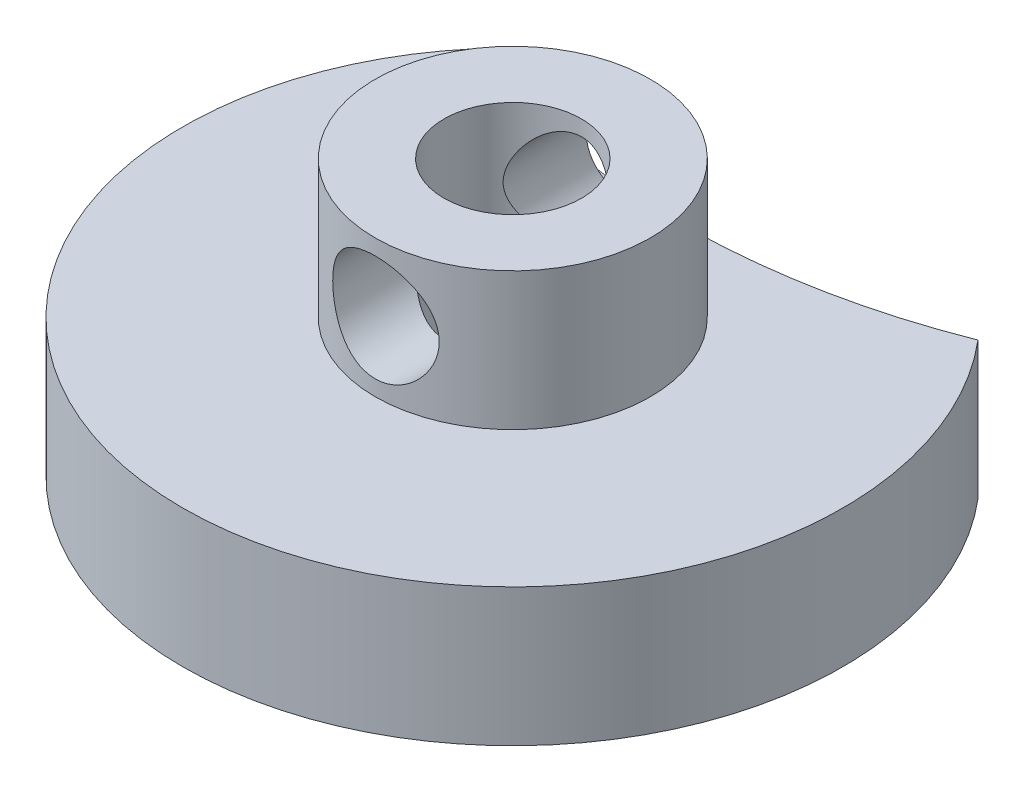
from build123d import *

# Parameters (mm, degrees)
SKETCH1_R                                  = 15.24
SKETCH1_R_2                                = 6.35
EXTRUDE1_DEPTH                             = 3.175
CUT_EXTRUDE5_DEPTH                         = 23.468593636
EXTRUDE2_START                             = -6.477
SKETCH3_R                                  = 6.35
SKETCH3_R_2                                = 3.175
EXTRUDE2_DEPTH                             = 16.002
F_10_0_1935_DIAMETER_HOLE1_D               = 4.9149
F_10_0_1935_DIAMETER_HOLE1_DEPTH           = 25.4
F_10_0_1935_DIAMETER_HOLE1_TIP             = 1.476584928
F_10_0_1935_DIAMETER_HOLE1_ON_FACE_2_D     = 4.9149
F_10_0_1935_DIAMETER_HOLE1_ON_FACE_2_DEPTH = 25.4
F_10_0_1935_DIAMETER_HOLE1_ON_FACE_2_TIP   = 1.476584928


with BuildPart() as part:
    # Sketch1 → Extrude1 (new, symmetric)
    with BuildSketch(Plane(origin=(0, 0, 0), x_dir=(1, 0, 0), z_dir=(0, 1, 0))):
        with Locations(Location((0, 0, 0), (0, 0, 270))):
            Circle(SKETCH1_R)
        with Locations(Location((0, 0, 0), (0, 0, 270))):
            Circle(SKETCH1_R_2, mode=Mode.SUBTRACT)
    extrude(amount=EXTRUDE1_DEPTH, both=True)

    # Sketch2 → Cut-Extrude5 (cut, through all)
    with BuildSketch(Plane(origin=(0, 3.175, 0), x_dir=(-1, 0, 0), z_dir=(0, 1, 0))):
        with BuildLine():
            ThreePointArc((11.644067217, -9.832258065), (0, -7.62), (-11.644067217, -9.832258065))
            ThreePointArc((-11.644067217, -9.832258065), (0, -15.24), (11.644067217, -9.832258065))
        make_face()
    extrude(amount=-CUT_EXTRUDE5_DEPTH, mode=Mode.SUBTRACT)

    # Sketch3 → Extrude2 (add)
    with BuildSketch(Plane(origin=(0, 0, 0), x_dir=(-1, 0, 0), z_dir=(0, 1, 0)).offset(EXTRUDE2_START)):
        with Locations(Location((0, 0, 0), (0, 0, 270))):
            Circle(SKETCH3_R)
        with Locations(Location((0, 0, 0), (0, 0, 270))):
            Circle(SKETCH3_R_2, mode=Mode.SUBTRACT)
    extrude(amount=EXTRUDE2_DEPTH)

    # 10 _0.1935_ Diameter Hole1
    with Locations(Plane(origin=(0, 6.35, 6.35), x_dir=(0, 1, 0), z_dir=(0, 0, 1))):
        with Locations((0, 0)):
            Hole(F_10_0_1935_DIAMETER_HOLE1_D / 2, depth=F_10_0_1935_DIAMETER_HOLE1_DEPTH)
            with Locations((0, 0, -(F_10_0_1935_DIAMETER_HOLE1_DEPTH + F_10_0_1935_DIAMETER_HOLE1_TIP / 2))):  # 118° drill point
                Cone(0, F_10_0_1935_DIAMETER_HOLE1_D / 2, F_10_0_1935_DIAMETER_HOLE1_TIP, mode=Mode.SUBTRACT)

    # 10 _0.1935_ Diameter Hole1 on face 2
    with Locations(Plane(origin=(0, 6.35, 0), x_dir=(0, 1, 0), z_dir=(0, 0, 1))):
        with Locations((0, 0)):
            Hole(F_10_0_1935_DIAMETER_HOLE1_ON_FACE_2_D / 2, depth=F_10_0_1935_DIAMETER_HOLE1_ON_FACE_2_DEPTH)
            with Locations((0, 0, -(F_10_0_1935_DIAMETER_HOLE1_ON_FACE_2_DEPTH + F_10_0_1935_DIAMETER_HOLE1_ON_FACE_2_TIP / 2))):  # 118° drill point
                Cone(0, F_10_0_1935_DIAMETER_HOLE1_ON_FACE_2_D / 2, F_10_0_1935_DIAMETER_HOLE1_ON_FACE_2_TIP, mode=Mode.SUBTRACT)


solid = part.part
